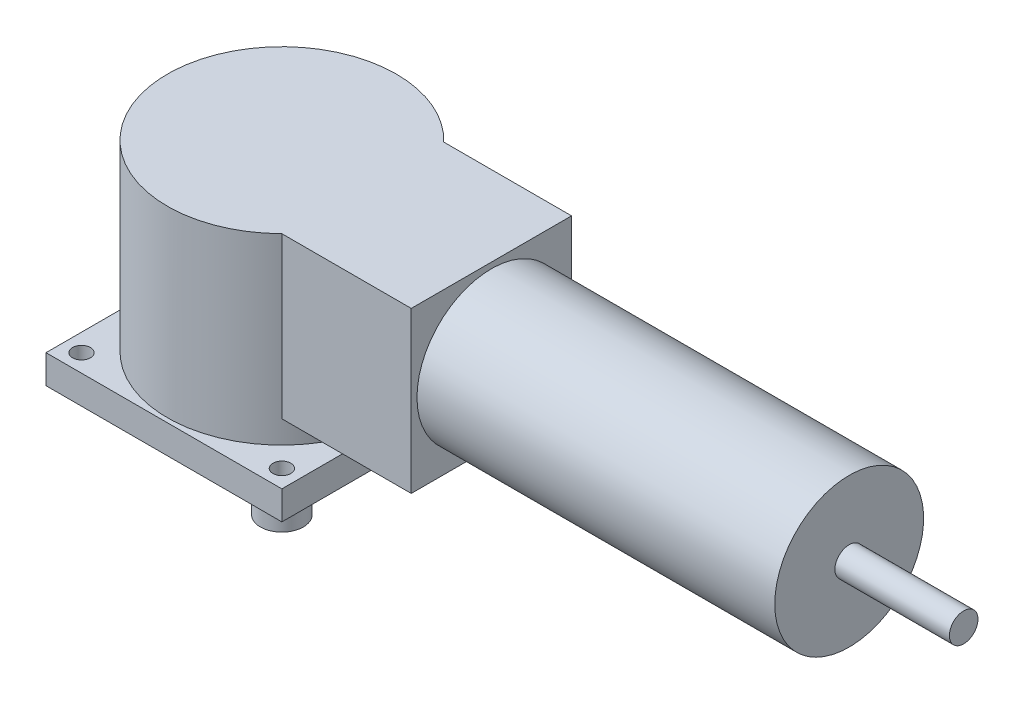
ISO-10303-21;
HEADER;
FILE_DESCRIPTION(('STEP AP214'),'2;1');
FILE_NAME('part.step','',(''),(''),'','','');
FILE_SCHEMA(('AUTOMOTIVE_DESIGN { 1 0 10303 214 1 1 1 1 }'));
ENDSEC;
DATA;
#1=APPLICATION_CONTEXT('core data for automotive mechanical design processes');
#2=APPLICATION_PROTOCOL_DEFINITION('international standard','automotive_design',2000,#1);
#3=PRODUCT_CONTEXT('',#1,'mechanical');
#4=PRODUCT('Part','Part','',(#3));
#5=PRODUCT_RELATED_PRODUCT_CATEGORY('part','',(#4));
#6=PRODUCT_DEFINITION_FORMATION('','',#4);
#7=PRODUCT_DEFINITION_CONTEXT('part definition',#1,'design');
#8=PRODUCT_DEFINITION('design','',#6,#7);
#9=PRODUCT_DEFINITION_SHAPE('','',#8);
#10=(LENGTH_UNIT() NAMED_UNIT(*) SI_UNIT(.MILLI.,.METRE.));
#11=(NAMED_UNIT(*) PLANE_ANGLE_UNIT() SI_UNIT($,.RADIAN.));
#12=(NAMED_UNIT(*) SI_UNIT($,.STERADIAN.) SOLID_ANGLE_UNIT());
#13=UNCERTAINTY_MEASURE_WITH_UNIT(LENGTH_MEASURE(1.E-05),#10,'distance_accuracy_value','');
#14=(GEOMETRIC_REPRESENTATION_CONTEXT(3) GLOBAL_UNCERTAINTY_ASSIGNED_CONTEXT((#13)) GLOBAL_UNIT_ASSIGNED_CONTEXT((#10,
#11,#12)) REPRESENTATION_CONTEXT('',''));
#15=CARTESIAN_POINT('',(0.,0.,0.));
#16=DIRECTION('',(0.,0.,1.));
#17=DIRECTION('',(1.,0.,0.));
#18=AXIS2_PLACEMENT_3D('',#15,#16,#17);
#19=CARTESIAN_POINT('',(-26.162,-2.794,26.162));
#20=DIRECTION('',(0.,-1.,0.));
#21=DIRECTION('',(0.,0.,-1.));
#22=AXIS2_PLACEMENT_3D('',#19,#20,#21);
#23=PLANE('',#22);
#24=CARTESIAN_POINT('',(-26.162,-2.794,26.162));
#25=DIRECTION('',(0.,-1.,0.));
#26=DIRECTION('',(0.,0.,-1.));
#27=AXIS2_PLACEMENT_3D('',#24,#25,#26);
#28=CIRCLE('',#27,15.875);
#29=CARTESIAN_POINT('',(-26.162,-2.794,10.287));
#30=VERTEX_POINT('',#29);
#31=EDGE_CURVE('E216',#30,#30,#28,.T.);
#32=ORIENTED_EDGE('',*,*,#31,.T.);
#33=EDGE_LOOP('',(#32));
#34=FACE_BOUND('',#33,.T.);
#35=CARTESIAN_POINT('',(-26.162,-2.794,26.162));
#36=DIRECTION('',(0.,-1.,0.));
#37=DIRECTION('',(0.,0.,-1.));
#38=AXIS2_PLACEMENT_3D('',#35,#36,#37);
#39=CIRCLE('',#38,4.7625);
#40=CARTESIAN_POINT('',(-26.162,-2.794,30.9245));
#41=VERTEX_POINT('',#40);
#42=EDGE_CURVE('E223',#41,#41,#39,.T.);
#43=ORIENTED_EDGE('',*,*,#42,.F.);
#44=EDGE_LOOP('',(#43));
#45=FACE_BOUND('',#44,.T.);
#46=ADVANCED_FACE('F38',(#34,#45),#23,.T.);
#47=CARTESIAN_POINT('',(0.,0.,52.324));
#48=DIRECTION('',(0.,-1.,0.));
#49=DIRECTION('',(0.,0.,-1.));
#50=AXIS2_PLACEMENT_3D('',#47,#48,#49);
#51=PLANE('',#50);
#52=DIRECTION('',(0.,0.,-1.));
#53=VECTOR('',#52,1.);
#54=CARTESIAN_POINT('',(0.,0.,0.));
#55=LINE('',#54,#53);
#56=CARTESIAN_POINT('',(0.,0.,52.324));
#57=VERTEX_POINT('',#56);
#58=CARTESIAN_POINT('',(0.,0.,0.));
#59=VERTEX_POINT('',#58);
#60=EDGE_CURVE('E175',#57,#59,#55,.T.);
#61=ORIENTED_EDGE('',*,*,#60,.F.);
#62=DIRECTION('',(1.,0.,0.));
#63=VECTOR('',#62,1.);
#64=CARTESIAN_POINT('',(0.,0.,52.324));
#65=LINE('',#64,#63);
#66=CARTESIAN_POINT('',(-52.324,0.,52.324));
#67=VERTEX_POINT('',#66);
#68=EDGE_CURVE('E83',#67,#57,#65,.T.);
#69=ORIENTED_EDGE('',*,*,#68,.F.);
#70=DIRECTION('',(0.,0.,1.));
#71=VECTOR('',#70,1.);
#72=CARTESIAN_POINT('',(-52.324,0.,0.));
#73=LINE('',#72,#71);
#74=CARTESIAN_POINT('',(-52.324,0.,0.));
#75=VERTEX_POINT('',#74);
#76=EDGE_CURVE('E187',#75,#67,#73,.T.);
#77=ORIENTED_EDGE('',*,*,#76,.F.);
#78=DIRECTION('',(-1.,0.,0.));
#79=VECTOR('',#78,1.);
#80=CARTESIAN_POINT('',(0.,0.,0.));
#81=LINE('',#80,#79);
#82=EDGE_CURVE('E185',#59,#75,#81,.T.);
#83=ORIENTED_EDGE('',*,*,#82,.F.);
#84=EDGE_LOOP('',(#61,#69,#77,#83));
#85=FACE_BOUND('',#84,.T.);
#86=CARTESIAN_POINT('',(-48.387,0.,3.937));
#87=DIRECTION('',(0.,-1.,0.));
#88=DIRECTION('',(0.,0.,-1.));
#89=AXIS2_PLACEMENT_3D('',#86,#87,#88);
#90=CIRCLE('',#89,1.984375);
#91=CARTESIAN_POINT('',(-48.387,0.,1.95262500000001));
#92=VERTEX_POINT('',#91);
#93=EDGE_CURVE('E172',#92,#92,#90,.T.);
#94=ORIENTED_EDGE('',*,*,#93,.F.);
#95=EDGE_LOOP('',(#94));
#96=FACE_BOUND('',#95,.T.);
#97=CARTESIAN_POINT('',(-48.387,0.,48.387));
#98=DIRECTION('',(0.,-1.,0.));
#99=DIRECTION('',(0.,0.,-1.));
#100=AXIS2_PLACEMENT_3D('',#97,#98,#99);
#101=CIRCLE('',#100,1.984375);
#102=CARTESIAN_POINT('',(-48.387,0.,46.402625));
#103=VERTEX_POINT('',#102);
#104=EDGE_CURVE('E168',#103,#103,#101,.T.);
#105=ORIENTED_EDGE('',*,*,#104,.F.);
#106=EDGE_LOOP('',(#105));
#107=FACE_BOUND('',#106,.T.);
#108=CARTESIAN_POINT('',(-3.937,0.,3.937));
#109=DIRECTION('',(0.,-1.,0.));
#110=DIRECTION('',(0.,0.,-1.));
#111=AXIS2_PLACEMENT_3D('',#108,#109,#110);
#112=CIRCLE('',#111,1.984375);
#113=CARTESIAN_POINT('',(-3.937,0.,1.952625));
#114=VERTEX_POINT('',#113);
#115=EDGE_CURVE('E164',#114,#114,#112,.T.);
#116=ORIENTED_EDGE('',*,*,#115,.F.);
#117=EDGE_LOOP('',(#116));
#118=FACE_BOUND('',#117,.T.);
#119=CARTESIAN_POINT('',(-3.937,0.,48.387));
#120=DIRECTION('',(0.,-1.,0.));
#121=DIRECTION('',(0.,0.,-1.));
#122=AXIS2_PLACEMENT_3D('',#119,#120,#121);
#123=CIRCLE('',#122,1.984375);
#124=CARTESIAN_POINT('',(-3.937,0.,46.402625));
#125=VERTEX_POINT('',#124);
#126=EDGE_CURVE('E160',#125,#125,#123,.T.);
#127=ORIENTED_EDGE('',*,*,#126,.F.);
#128=EDGE_LOOP('',(#127));
#129=FACE_BOUND('',#128,.T.);
#130=CARTESIAN_POINT('',(-26.162,0.,26.162));
#131=DIRECTION('',(0.,-1.,0.));
#132=DIRECTION('',(0.,0.,-1.));
#133=AXIS2_PLACEMENT_3D('',#130,#131,#132);
#134=CIRCLE('',#133,15.875);
#135=CARTESIAN_POINT('',(-26.162,0.,10.287));
#136=VERTEX_POINT('',#135);
#137=EDGE_CURVE('E214',#136,#136,#134,.T.);
#138=ORIENTED_EDGE('',*,*,#137,.F.);
#139=EDGE_LOOP('',(#138));
#140=FACE_BOUND('',#139,.T.);
#141=ADVANCED_FACE('F206',(#85,#96,#107,#118,#129,#140),#51,.T.);
#142=CARTESIAN_POINT('',(99.695,29.21,26.162));
#143=DIRECTION('',(1.,0.,0.));
#144=DIRECTION('',(0.,0.,-1.));
#145=AXIS2_PLACEMENT_3D('',#142,#143,#144);
#146=PLANE('',#145);
#147=CARTESIAN_POINT('',(99.695,29.21,26.162));
#148=DIRECTION('',(1.,0.,0.));
#149=DIRECTION('',(0.,0.,-1.));
#150=AXIS2_PLACEMENT_3D('',#147,#148,#149);
#151=CIRCLE('',#150,16.51);
#152=CARTESIAN_POINT('',(99.695,29.21,42.672));
#153=VERTEX_POINT('',#152);
#154=EDGE_CURVE('E135',#153,#153,#151,.T.);
#155=ORIENTED_EDGE('',*,*,#154,.T.);
#156=EDGE_LOOP('',(#155));
#157=FACE_BOUND('',#156,.T.);
#158=CARTESIAN_POINT('',(99.695,29.21,26.162));
#159=DIRECTION('',(1.,0.,0.));
#160=DIRECTION('',(0.,0.,-1.));
#161=AXIS2_PLACEMENT_3D('',#158,#159,#160);
#162=CIRCLE('',#161,3.175);
#163=CARTESIAN_POINT('',(99.695,29.21,22.987));
#164=VERTEX_POINT('',#163);
#165=EDGE_CURVE('E220',#164,#164,#162,.T.);
#166=ORIENTED_EDGE('',*,*,#165,.F.);
#167=EDGE_LOOP('',(#166));
#168=FACE_BOUND('',#167,.T.);
#169=ADVANCED_FACE('F209',(#157,#168),#146,.T.);
#170=CARTESIAN_POINT('',(20.32,6.35,0.));
#171=DIRECTION('',(1.,0.,0.));
#172=DIRECTION('',(0.,0.,-1.));
#173=AXIS2_PLACEMENT_3D('',#170,#171,#172);
#174=PLANE('',#173);
#175=DIRECTION('',(0.,0.,-1.));
#176=VECTOR('',#175,1.);
#177=CARTESIAN_POINT('',(20.32,11.43,8.38200000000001));
#178=LINE('',#177,#176);
#179=CARTESIAN_POINT('',(20.32,11.43,43.942));
#180=VERTEX_POINT('',#179);
#181=CARTESIAN_POINT('',(20.32,11.43,8.382));
#182=VERTEX_POINT('',#181);
#183=EDGE_CURVE('E128',#180,#182,#178,.T.);
#184=ORIENTED_EDGE('',*,*,#183,.T.);
#185=DIRECTION('',(0.,1.,0.));
#186=VECTOR('',#185,1.);
#187=CARTESIAN_POINT('',(20.32,46.99,8.38200000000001));
#188=LINE('',#187,#186);
#189=CARTESIAN_POINT('',(20.32,46.99,8.38200000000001));
#190=VERTEX_POINT('',#189);
#191=EDGE_CURVE('E134',#182,#190,#188,.T.);
#192=ORIENTED_EDGE('',*,*,#191,.T.);
#193=DIRECTION('',(0.,0.,1.));
#194=VECTOR('',#193,1.);
#195=CARTESIAN_POINT('',(20.32,46.99,8.38200000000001));
#196=LINE('',#195,#194);
#197=CARTESIAN_POINT('',(20.32,46.99,43.942));
#198=VERTEX_POINT('',#197);
#199=EDGE_CURVE('E139',#190,#198,#196,.T.);
#200=ORIENTED_EDGE('',*,*,#199,.T.);
#201=DIRECTION('',(0.,-1.,0.));
#202=VECTOR('',#201,1.);
#203=CARTESIAN_POINT('',(20.32,46.99,43.942));
#204=LINE('',#203,#202);
#205=EDGE_CURVE('E118',#198,#180,#204,.T.);
#206=ORIENTED_EDGE('',*,*,#205,.T.);
#207=EDGE_LOOP('',(#184,#192,#200,#206));
#208=FACE_BOUND('',#207,.T.);
#209=CARTESIAN_POINT('',(20.32,29.21,26.162));
#210=DIRECTION('',(1.,0.,0.));
#211=DIRECTION('',(0.,0.,-1.));
#212=AXIS2_PLACEMENT_3D('',#209,#210,#211);
#213=CIRCLE('',#212,16.51);
#214=CARTESIAN_POINT('',(20.32,29.21,42.672));
#215=VERTEX_POINT('',#214);
#216=EDGE_CURVE('E145',#215,#215,#213,.T.);
#217=ORIENTED_EDGE('',*,*,#216,.F.);
#218=EDGE_LOOP('',(#217));
#219=FACE_BOUND('',#218,.T.);
#220=ADVANCED_FACE('F137',(#208,#219),#174,.T.);
#221=CARTESIAN_POINT('',(0.,6.35,52.324));
#222=DIRECTION('',(0.,-1.,0.));
#223=DIRECTION('',(0.,0.,-1.));
#224=AXIS2_PLACEMENT_3D('',#221,#222,#223);
#225=PLANE('',#224);
#226=DIRECTION('',(0.,0.,-1.));
#227=VECTOR('',#226,1.);
#228=CARTESIAN_POINT('',(0.,6.35,0.));
#229=LINE('',#228,#227);
#230=CARTESIAN_POINT('',(0.,6.35,52.324));
#231=VERTEX_POINT('',#230);
#232=CARTESIAN_POINT('',(0.,6.35,0.));
#233=VERTEX_POINT('',#232);
#234=EDGE_CURVE('E176',#231,#233,#229,.T.);
#235=ORIENTED_EDGE('',*,*,#234,.T.);
#236=DIRECTION('',(-1.,0.,0.));
#237=VECTOR('',#236,1.);
#238=CARTESIAN_POINT('',(0.,6.35,0.));
#239=LINE('',#238,#237);
#240=CARTESIAN_POINT('',(-52.324,6.35,0.));
#241=VERTEX_POINT('',#240);
#242=EDGE_CURVE('E91',#233,#241,#239,.T.);
#243=ORIENTED_EDGE('',*,*,#242,.T.);
#244=DIRECTION('',(0.,0.,1.));
#245=VECTOR('',#244,1.);
#246=CARTESIAN_POINT('',(-52.324,6.35,0.));
#247=LINE('',#246,#245);
#248=CARTESIAN_POINT('',(-52.324,6.35,52.324));
#249=VERTEX_POINT('',#248);
#250=EDGE_CURVE('E179',#241,#249,#247,.T.);
#251=ORIENTED_EDGE('',*,*,#250,.T.);
#252=DIRECTION('',(1.,0.,0.));
#253=VECTOR('',#252,1.);
#254=CARTESIAN_POINT('',(0.,6.35,52.324));
#255=LINE('',#254,#253);
#256=EDGE_CURVE('E62',#249,#231,#255,.T.);
#257=ORIENTED_EDGE('',*,*,#256,.T.);
#258=EDGE_LOOP('',(#235,#243,#251,#257));
#259=FACE_BOUND('',#258,.T.);
#260=CARTESIAN_POINT('',(-48.387,6.35,3.937));
#261=DIRECTION('',(0.,1.,0.));
#262=DIRECTION('',(0.,0.,1.));
#263=AXIS2_PLACEMENT_3D('',#260,#261,#262);
#264=CIRCLE('',#263,1.984375);
#265=CARTESIAN_POINT('',(-48.387,6.35,5.921375));
#266=VERTEX_POINT('',#265);
#267=EDGE_CURVE('E169',#266,#266,#264,.T.);
#268=ORIENTED_EDGE('',*,*,#267,.F.);
#269=EDGE_LOOP('',(#268));
#270=FACE_BOUND('',#269,.T.);
#271=CARTESIAN_POINT('',(-48.387,6.35,48.387));
#272=DIRECTION('',(0.,1.,0.));
#273=DIRECTION('',(0.,0.,1.));
#274=AXIS2_PLACEMENT_3D('',#271,#272,#273);
#275=CIRCLE('',#274,1.984375);
#276=CARTESIAN_POINT('',(-48.387,6.35,50.371375));
#277=VERTEX_POINT('',#276);
#278=EDGE_CURVE('E165',#277,#277,#275,.T.);
#279=ORIENTED_EDGE('',*,*,#278,.F.);
#280=EDGE_LOOP('',(#279));
#281=FACE_BOUND('',#280,.T.);
#282=CARTESIAN_POINT('',(-3.937,6.35,3.937));
#283=DIRECTION('',(0.,1.,0.));
#284=DIRECTION('',(0.,0.,1.));
#285=AXIS2_PLACEMENT_3D('',#282,#283,#284);
#286=CIRCLE('',#285,1.984375);
#287=CARTESIAN_POINT('',(-3.937,6.35,5.921375));
#288=VERTEX_POINT('',#287);
#289=EDGE_CURVE('E161',#288,#288,#286,.T.);
#290=ORIENTED_EDGE('',*,*,#289,.F.);
#291=EDGE_LOOP('',(#290));
#292=FACE_BOUND('',#291,.T.);
#293=CARTESIAN_POINT('',(-3.937,6.35,48.387));
#294=DIRECTION('',(0.,1.,0.));
#295=DIRECTION('',(0.,0.,1.));
#296=AXIS2_PLACEMENT_3D('',#293,#294,#295);
#297=CIRCLE('',#296,1.984375);
#298=CARTESIAN_POINT('',(-3.937,6.35,50.371375));
#299=VERTEX_POINT('',#298);
#300=EDGE_CURVE('E157',#299,#299,#297,.T.);
#301=ORIENTED_EDGE('',*,*,#300,.F.);
#302=EDGE_LOOP('',(#301));
#303=FACE_BOUND('',#302,.T.);
#304=CARTESIAN_POINT('',(-26.3525,6.35,25.9715));
#305=DIRECTION('',(0.,-1.,0.));
#306=DIRECTION('',(0.,0.,-1.));
#307=AXIS2_PLACEMENT_3D('',#304,#305,#306);
#308=CIRCLE('',#307,25.4);
#309=CARTESIAN_POINT('',(-26.3525,6.35,0.571500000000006));
#310=VERTEX_POINT('',#309);
#311=EDGE_CURVE('E12',#310,#310,#308,.F.);
#312=ORIENTED_EDGE('',*,*,#311,.F.);
#313=EDGE_LOOP('',(#312));
#314=FACE_BOUND('',#313,.T.);
#315=ADVANCED_FACE('F239',(#259,#270,#281,#292,#303,#314),#225,.F.);
#316=CARTESIAN_POINT('',(0.,6.35,0.));
#317=DIRECTION('',(-1.,0.,0.));
#318=DIRECTION('',(0.,0.,1.));
#319=AXIS2_PLACEMENT_3D('',#316,#317,#318);
#320=PLANE('',#319);
#321=ORIENTED_EDGE('',*,*,#60,.T.);
#322=DIRECTION('',(0.,-1.,0.));
#323=VECTOR('',#322,1.);
#324=CARTESIAN_POINT('',(0.,6.35,0.));
#325=LINE('',#324,#323);
#326=EDGE_CURVE('E46',#233,#59,#325,.T.);
#327=ORIENTED_EDGE('',*,*,#326,.F.);
#328=ORIENTED_EDGE('',*,*,#234,.F.);
#329=DIRECTION('',(0.,-1.,0.));
#330=VECTOR('',#329,1.);
#331=CARTESIAN_POINT('',(0.,6.35,52.324));
#332=LINE('',#331,#330);
#333=EDGE_CURVE('E182',#231,#57,#332,.T.);
#334=ORIENTED_EDGE('',*,*,#333,.T.);
#335=EDGE_LOOP('',(#321,#327,#328,#334));
#336=FACE_BOUND('',#335,.T.);
#337=ADVANCED_FACE('F40',(#336),#320,.F.);
#338=CARTESIAN_POINT('',(0.,6.35,0.));
#339=DIRECTION('',(0.,0.,1.));
#340=DIRECTION('',(1.,0.,0.));
#341=AXIS2_PLACEMENT_3D('',#338,#339,#340);
#342=PLANE('',#341);
#343=ORIENTED_EDGE('',*,*,#82,.T.);
#344=DIRECTION('',(0.,-1.,0.));
#345=VECTOR('',#344,1.);
#346=CARTESIAN_POINT('',(-52.324,6.35,0.));
#347=LINE('',#346,#345);
#348=EDGE_CURVE('E193',#241,#75,#347,.T.);
#349=ORIENTED_EDGE('',*,*,#348,.F.);
#350=ORIENTED_EDGE('',*,*,#242,.F.);
#351=ORIENTED_EDGE('',*,*,#326,.T.);
#352=EDGE_LOOP('',(#343,#349,#350,#351));
#353=FACE_BOUND('',#352,.T.);
#354=ADVANCED_FACE('F310',(#353),#342,.F.);
#355=CARTESIAN_POINT('',(-52.324,6.35,0.));
#356=DIRECTION('',(1.,0.,0.));
#357=DIRECTION('',(0.,0.,-1.));
#358=AXIS2_PLACEMENT_3D('',#355,#356,#357);
#359=PLANE('',#358);
#360=ORIENTED_EDGE('',*,*,#76,.T.);
#361=DIRECTION('',(0.,-1.,0.));
#362=VECTOR('',#361,1.);
#363=CARTESIAN_POINT('',(-52.324,6.35,52.324));
#364=LINE('',#363,#362);
#365=EDGE_CURVE('E191',#249,#67,#364,.T.);
#366=ORIENTED_EDGE('',*,*,#365,.F.);
#367=ORIENTED_EDGE('',*,*,#250,.F.);
#368=ORIENTED_EDGE('',*,*,#348,.T.);
#369=EDGE_LOOP('',(#360,#366,#367,#368));
#370=FACE_BOUND('',#369,.T.);
#371=ADVANCED_FACE('F308',(#370),#359,.F.);
#372=CARTESIAN_POINT('',(0.,6.35,52.324));
#373=DIRECTION('',(0.,0.,-1.));
#374=DIRECTION('',(-1.,0.,0.));
#375=AXIS2_PLACEMENT_3D('',#372,#373,#374);
#376=PLANE('',#375);
#377=ORIENTED_EDGE('',*,*,#68,.T.);
#378=ORIENTED_EDGE('',*,*,#333,.F.);
#379=ORIENTED_EDGE('',*,*,#256,.F.);
#380=ORIENTED_EDGE('',*,*,#365,.T.);
#381=EDGE_LOOP('',(#377,#378,#379,#380));
#382=FACE_BOUND('',#381,.T.);
#383=ADVANCED_FACE('F303',(#382),#376,.F.);
#384=CARTESIAN_POINT('',(-48.387,6.35,3.937));
#385=DIRECTION('',(0.,1.,0.));
#386=DIRECTION('',(0.,0.,1.));
#387=AXIS2_PLACEMENT_3D('',#384,#385,#386);
#388=CYLINDRICAL_SURFACE('',#387,1.984375);
#389=ORIENTED_EDGE('',*,*,#93,.T.);
#390=EDGE_LOOP('',(#389));
#391=FACE_BOUND('',#390,.T.);
#392=ORIENTED_EDGE('',*,*,#267,.T.);
#393=EDGE_LOOP('',(#392));
#394=FACE_BOUND('',#393,.T.);
#395=ADVANCED_FACE('F300',(#391,#394),#388,.F.);
#396=CARTESIAN_POINT('',(-48.387,6.35,48.387));
#397=DIRECTION('',(0.,1.,0.));
#398=DIRECTION('',(0.,0.,1.));
#399=AXIS2_PLACEMENT_3D('',#396,#397,#398);
#400=CYLINDRICAL_SURFACE('',#399,1.984375);
#401=ORIENTED_EDGE('',*,*,#104,.T.);
#402=EDGE_LOOP('',(#401));
#403=FACE_BOUND('',#402,.T.);
#404=ORIENTED_EDGE('',*,*,#278,.T.);
#405=EDGE_LOOP('',(#404));
#406=FACE_BOUND('',#405,.T.);
#407=ADVANCED_FACE('F296',(#403,#406),#400,.F.);
#408=CARTESIAN_POINT('',(-3.937,6.35,3.937));
#409=DIRECTION('',(0.,1.,0.));
#410=DIRECTION('',(0.,0.,1.));
#411=AXIS2_PLACEMENT_3D('',#408,#409,#410);
#412=CYLINDRICAL_SURFACE('',#411,1.984375);
#413=ORIENTED_EDGE('',*,*,#115,.T.);
#414=EDGE_LOOP('',(#413));
#415=FACE_BOUND('',#414,.T.);
#416=ORIENTED_EDGE('',*,*,#289,.T.);
#417=EDGE_LOOP('',(#416));
#418=FACE_BOUND('',#417,.T.);
#419=ADVANCED_FACE('F293',(#415,#418),#412,.F.);
#420=CARTESIAN_POINT('',(-3.937,6.35,48.387));
#421=DIRECTION('',(0.,1.,0.));
#422=DIRECTION('',(0.,0.,1.));
#423=AXIS2_PLACEMENT_3D('',#420,#421,#422);
#424=CYLINDRICAL_SURFACE('',#423,1.984375);
#425=ORIENTED_EDGE('',*,*,#126,.T.);
#426=EDGE_LOOP('',(#425));
#427=FACE_BOUND('',#426,.T.);
#428=ORIENTED_EDGE('',*,*,#300,.T.);
#429=EDGE_LOOP('',(#428));
#430=FACE_BOUND('',#429,.T.);
#431=ADVANCED_FACE('F203',(#427,#430),#424,.F.);
#432=CARTESIAN_POINT('',(-26.3525,46.99,25.9715));
#433=DIRECTION('',(0.,-1.,0.));
#434=DIRECTION('',(0.,0.,-1.));
#435=AXIS2_PLACEMENT_3D('',#432,#433,#434);
#436=CYLINDRICAL_SURFACE('',#435,25.4);
#437=CARTESIAN_POINT('',(-26.3525,46.99,25.9715));
#438=DIRECTION('',(0.,1.,0.));
#439=DIRECTION('',(0.,0.,1.));
#440=AXIS2_PLACEMENT_3D('',#437,#438,#439);
#441=CIRCLE('',#440,25.4);
#442=CARTESIAN_POINT('',(-8.02848598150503,46.99,8.38200000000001));
#443=VERTEX_POINT('',#442);
#444=CARTESIAN_POINT('',(-8.40198107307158,46.99,43.942));
#445=VERTEX_POINT('',#444);
#446=EDGE_CURVE('E155',#443,#445,#441,.T.);
#447=ORIENTED_EDGE('',*,*,#446,.F.);
#448=DIRECTION('',(0.,-1.,0.));
#449=VECTOR('',#448,1.);
#450=CARTESIAN_POINT('',(-8.02848598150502,46.99,8.38200000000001));
#451=LINE('',#450,#449);
#452=CARTESIAN_POINT('',(-8.02848598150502,11.43,8.38200000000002));
#453=VERTEX_POINT('',#452);
#454=EDGE_CURVE('E140',#453,#443,#451,.F.);
#455=ORIENTED_EDGE('',*,*,#454,.F.);
#456=CARTESIAN_POINT('',(-26.3525,11.43,25.9715));
#457=DIRECTION('',(0.,-1.,0.));
#458=DIRECTION('',(0.,0.,-1.));
#459=AXIS2_PLACEMENT_3D('',#456,#457,#458);
#460=CIRCLE('',#459,25.4);
#461=CARTESIAN_POINT('',(-8.40198107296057,11.43,43.942));
#462=VERTEX_POINT('',#461);
#463=EDGE_CURVE('E150',#462,#453,#460,.F.);
#464=ORIENTED_EDGE('',*,*,#463,.F.);
#465=DIRECTION('',(0.,-1.,0.));
#466=VECTOR('',#465,1.);
#467=CARTESIAN_POINT('',(-8.40198107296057,46.99,43.942));
#468=LINE('',#467,#466);
#469=EDGE_CURVE('E121',#445,#462,#468,.T.);
#470=ORIENTED_EDGE('',*,*,#469,.F.);
#471=EDGE_LOOP('',(#447,#455,#464,#470));
#472=FACE_BOUND('',#471,.T.);
#473=ORIENTED_EDGE('',*,*,#311,.T.);
#474=EDGE_LOOP('',(#473));
#475=FACE_BOUND('',#474,.T.);
#476=ADVANCED_FACE('F285',(#472,#475),#436,.T.);
#477=CARTESIAN_POINT('',(-26.3525,46.99,25.9715));
#478=DIRECTION('',(0.,1.,0.));
#479=DIRECTION('',(0.,0.,1.));
#480=AXIS2_PLACEMENT_3D('',#477,#478,#479);
#481=PLANE('',#480);
#482=ORIENTED_EDGE('',*,*,#446,.T.);
#483=DIRECTION('',(1.,0.,0.));
#484=VECTOR('',#483,1.);
#485=CARTESIAN_POINT('',(-500000.,46.99,43.9420000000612));
#486=LINE('',#485,#484);
#487=EDGE_CURVE('E125',#445,#198,#486,.T.);
#488=ORIENTED_EDGE('',*,*,#487,.T.);
#489=ORIENTED_EDGE('',*,*,#199,.F.);
#490=DIRECTION('',(1.,0.,0.));
#491=VECTOR('',#490,1.);
#492=CARTESIAN_POINT('',(-500000.,46.99,8.38200000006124));
#493=LINE('',#492,#491);
#494=EDGE_CURVE('E53',#443,#190,#493,.T.);
#495=ORIENTED_EDGE('',*,*,#494,.F.);
#496=EDGE_LOOP('',(#482,#488,#489,#495));
#497=FACE_BOUND('',#496,.T.);
#498=ADVANCED_FACE('F277',(#497),#481,.T.);
#499=CARTESIAN_POINT('',(-500000.,46.99,8.38200000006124));
#500=DIRECTION('',(0.,0.,-1.));
#501=DIRECTION('',(0.,1.,0.));
#502=AXIS2_PLACEMENT_3D('',#499,#500,#501);
#503=PLANE('',#502);
#504=DIRECTION('',(1.,0.,0.));
#505=VECTOR('',#504,1.);
#506=CARTESIAN_POINT('',(-500000.,11.43,8.38200000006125));
#507=LINE('',#506,#505);
#508=EDGE_CURVE('E124',#453,#182,#507,.T.);
#509=ORIENTED_EDGE('',*,*,#508,.F.);
#510=ORIENTED_EDGE('',*,*,#454,.T.);
#511=ORIENTED_EDGE('',*,*,#494,.T.);
#512=ORIENTED_EDGE('',*,*,#191,.F.);
#513=EDGE_LOOP('',(#509,#510,#511,#512));
#514=FACE_BOUND('',#513,.T.);
#515=ADVANCED_FACE('F272',(#514),#503,.T.);
#516=CARTESIAN_POINT('',(-500000.,46.99,43.9420000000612));
#517=DIRECTION('',(0.,0.,1.));
#518=DIRECTION('',(0.,-1.,0.));
#519=AXIS2_PLACEMENT_3D('',#516,#517,#518);
#520=PLANE('',#519);
#521=ORIENTED_EDGE('',*,*,#487,.F.);
#522=ORIENTED_EDGE('',*,*,#469,.T.);
#523=DIRECTION('',(1.,0.,0.));
#524=VECTOR('',#523,1.);
#525=CARTESIAN_POINT('',(-500000.,11.43,43.9420000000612));
#526=LINE('',#525,#524);
#527=EDGE_CURVE('E114',#462,#180,#526,.T.);
#528=ORIENTED_EDGE('',*,*,#527,.T.);
#529=ORIENTED_EDGE('',*,*,#205,.F.);
#530=EDGE_LOOP('',(#521,#522,#528,#529));
#531=FACE_BOUND('',#530,.T.);
#532=ADVANCED_FACE('F116',(#531),#520,.T.);
#533=CARTESIAN_POINT('',(-500000.,11.43,8.38200000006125));
#534=DIRECTION('',(0.,-1.,0.));
#535=DIRECTION('',(0.,0.,-1.));
#536=AXIS2_PLACEMENT_3D('',#533,#534,#535);
#537=PLANE('',#536);
#538=ORIENTED_EDGE('',*,*,#527,.F.);
#539=ORIENTED_EDGE('',*,*,#463,.T.);
#540=ORIENTED_EDGE('',*,*,#508,.T.);
#541=ORIENTED_EDGE('',*,*,#183,.F.);
#542=EDGE_LOOP('',(#538,#539,#540,#541));
#543=FACE_BOUND('',#542,.T.);
#544=ADVANCED_FACE('F129',(#543),#537,.T.);
#545=CARTESIAN_POINT('',(99.695,29.21,26.162));
#546=DIRECTION('',(-1.,0.,0.));
#547=DIRECTION('',(0.,0.,1.));
#548=AXIS2_PLACEMENT_3D('',#545,#546,#547);
#549=CYLINDRICAL_SURFACE('',#548,16.51);
#550=CARTESIAN_POINT('',(99.695,29.21,42.672));
#551=CARTESIAN_POINT('',(98.8681770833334,29.21,42.672));
#552=CARTESIAN_POINT('',(98.0413541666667,29.21,42.672));
#553=CARTESIAN_POINT('',(96.3877083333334,29.21,42.672));
#554=CARTESIAN_POINT('',(95.5608854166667,29.21,42.672));
#555=CARTESIAN_POINT('',(93.9072395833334,29.21,42.672));
#556=CARTESIAN_POINT('',(93.0804166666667,29.21,42.672));
#557=CARTESIAN_POINT('',(91.4267708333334,29.21,42.672));
#558=CARTESIAN_POINT('',(90.5999479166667,29.21,42.672));
#559=CARTESIAN_POINT('',(88.9463020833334,29.21,42.672));
#560=CARTESIAN_POINT('',(88.1194791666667,29.21,42.672));
#561=CARTESIAN_POINT('',(86.4658333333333,29.21,42.672));
#562=CARTESIAN_POINT('',(85.6390104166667,29.21,42.672));
#563=CARTESIAN_POINT('',(83.9853645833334,29.21,42.672));
#564=CARTESIAN_POINT('',(83.1585416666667,29.21,42.672));
#565=CARTESIAN_POINT('',(81.5048958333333,29.21,42.672));
#566=CARTESIAN_POINT('',(80.6780729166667,29.21,42.672));
#567=CARTESIAN_POINT('',(79.0244270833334,29.21,42.672));
#568=CARTESIAN_POINT('',(78.1976041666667,29.21,42.672));
#569=CARTESIAN_POINT('',(76.5439583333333,29.21,42.672));
#570=CARTESIAN_POINT('',(75.7171354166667,29.21,42.672));
#571=CARTESIAN_POINT('',(74.0634895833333,29.21,42.672));
#572=CARTESIAN_POINT('',(73.2366666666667,29.21,42.672));
#573=CARTESIAN_POINT('',(71.5830208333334,29.21,42.672));
#574=CARTESIAN_POINT('',(70.7561979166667,29.21,42.672));
#575=CARTESIAN_POINT('',(69.1025520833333,29.21,42.672));
#576=CARTESIAN_POINT('',(68.2757291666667,29.21,42.672));
#577=CARTESIAN_POINT('',(66.6220833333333,29.21,42.672));
#578=CARTESIAN_POINT('',(65.7952604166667,29.21,42.672));
#579=CARTESIAN_POINT('',(64.1416145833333,29.21,42.672));
#580=CARTESIAN_POINT('',(63.3147916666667,29.21,42.672));
#581=CARTESIAN_POINT('',(61.6611458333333,29.21,42.672));
#582=CARTESIAN_POINT('',(60.8343229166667,29.21,42.672));
#583=CARTESIAN_POINT('',(59.1806770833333,29.21,42.672));
#584=CARTESIAN_POINT('',(58.3538541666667,29.21,42.672));
#585=CARTESIAN_POINT('',(56.7002083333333,29.21,42.672));
#586=CARTESIAN_POINT('',(55.8733854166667,29.21,42.672));
#587=CARTESIAN_POINT('',(54.2197395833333,29.21,42.672));
#588=CARTESIAN_POINT('',(53.3929166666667,29.21,42.672));
#589=CARTESIAN_POINT('',(51.7392708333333,29.21,42.672));
#590=CARTESIAN_POINT('',(50.9124479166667,29.21,42.672));
#591=CARTESIAN_POINT('',(49.2588020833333,29.21,42.672));
#592=CARTESIAN_POINT('',(48.4319791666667,29.21,42.672));
#593=CARTESIAN_POINT('',(46.7783333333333,29.21,42.672));
#594=CARTESIAN_POINT('',(45.9515104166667,29.21,42.672));
#595=CARTESIAN_POINT('',(44.2978645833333,29.21,42.672));
#596=CARTESIAN_POINT('',(43.4710416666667,29.21,42.672));
#597=CARTESIAN_POINT('',(41.8173958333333,29.21,42.672));
#598=CARTESIAN_POINT('',(40.9905729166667,29.21,42.672));
#599=CARTESIAN_POINT('',(39.3369270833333,29.21,42.672));
#600=CARTESIAN_POINT('',(38.5101041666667,29.21,42.672));
#601=CARTESIAN_POINT('',(36.8564583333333,29.21,42.672));
#602=CARTESIAN_POINT('',(36.0296354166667,29.21,42.672));
#603=CARTESIAN_POINT('',(34.3759895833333,29.21,42.672));
#604=CARTESIAN_POINT('',(33.5491666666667,29.21,42.672));
#605=CARTESIAN_POINT('',(31.8955208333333,29.21,42.672));
#606=CARTESIAN_POINT('',(31.0686979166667,29.21,42.672));
#607=CARTESIAN_POINT('',(29.4150520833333,29.21,42.672));
#608=CARTESIAN_POINT('',(28.5882291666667,29.21,42.672));
#609=CARTESIAN_POINT('',(26.9345833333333,29.21,42.672));
#610=CARTESIAN_POINT('',(26.1077604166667,29.21,42.672));
#611=CARTESIAN_POINT('',(24.4541145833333,29.21,42.672));
#612=CARTESIAN_POINT('',(23.6272916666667,29.21,42.672));
#613=CARTESIAN_POINT('',(21.9736458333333,29.21,42.672));
#614=CARTESIAN_POINT('',(21.1468229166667,29.21,42.672));
#615=CARTESIAN_POINT('',(20.32,29.21,42.672));
#616=B_SPLINE_CURVE_WITH_KNOTS('',3,(#550,#551,#552,#553,#554,#555,#556,#557,#558,#559,#560,
#561,#562,#563,#564,#565,#566,#567,#568,#569,#570,#571,#572,#573,#574,#575,#576,#577,#578,#579,
#580,#581,#582,#583,#584,#585,#586,#587,#588,#589,#590,#591,#592,#593,#594,#595,#596,#597,#598,
#599,#600,#601,#602,#603,#604,#605,#606,#607,#608,#609,#610,#611,#612,#613,#614,#615),
.UNSPECIFIED.,.F.,.F.,(4,2,2,2,2,2,2,2,2,2,2,2,2,2,2,2,2,2,2,2,2,2,2,2,2,2,2,2,2,2,2,2,4),(0.,
2.48046875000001,4.96093750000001,7.44140625,9.92187500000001,12.40234375,14.8828125,
17.36328125,19.84375,22.32421875,24.8046875,27.28515625,29.765625,32.24609375,34.7265625,
37.20703125,39.6875,42.16796875,44.6484375,47.12890625,49.609375,52.08984375,54.5703125,
57.05078125,59.53125,62.01171875,64.4921875,66.97265625,69.453125,71.93359375,74.4140625,
76.89453125,79.375),.UNSPECIFIED.);
#617=EDGE_CURVE('BSEAM237',#153,#215,#616,.T.);
#618=ORIENTED_EDGE('',*,*,#154,.F.);
#619=ORIENTED_EDGE('',*,*,#216,.T.);
#620=ORIENTED_EDGE('',*,*,#617,.T.);
#621=ORIENTED_EDGE('',*,*,#617,.F.);
#622=EDGE_LOOP('',(#618,#620,#619,#621));
#623=FACE_BOUND('',#622,.T.);
#624=ADVANCED_FACE('F237',(#623),#549,.T.);
#625=CARTESIAN_POINT('',(125.095,29.21,26.162));
#626=DIRECTION('',(-1.,0.,0.));
#627=DIRECTION('',(0.,0.,1.));
#628=AXIS2_PLACEMENT_3D('',#625,#626,#627);
#629=CYLINDRICAL_SURFACE('',#628,3.175);
#630=CARTESIAN_POINT('',(125.095,29.21,26.162));
#631=DIRECTION('',(1.,0.,0.));
#632=DIRECTION('',(0.,0.,-1.));
#633=AXIS2_PLACEMENT_3D('',#630,#631,#632);
#634=CIRCLE('',#633,3.175);
#635=CARTESIAN_POINT('',(125.095,29.21,22.987));
#636=VERTEX_POINT('',#635);
#637=EDGE_CURVE('E227',#636,#636,#634,.T.);
#638=ORIENTED_EDGE('',*,*,#637,.F.);
#639=EDGE_LOOP('',(#638));
#640=FACE_BOUND('',#639,.T.);
#641=ORIENTED_EDGE('',*,*,#165,.T.);
#642=EDGE_LOOP('',(#641));
#643=FACE_BOUND('',#642,.T.);
#644=ADVANCED_FACE('F266',(#640,#643),#629,.T.);
#645=CARTESIAN_POINT('',(125.095,29.21,26.162));
#646=DIRECTION('',(1.,0.,0.));
#647=DIRECTION('',(0.,0.,-1.));
#648=AXIS2_PLACEMENT_3D('',#645,#646,#647);
#649=PLANE('',#648);
#650=ORIENTED_EDGE('',*,*,#637,.T.);
#651=EDGE_LOOP('',(#650));
#652=FACE_BOUND('',#651,.T.);
#653=ADVANCED_FACE('F262',(#652),#649,.T.);
#654=CARTESIAN_POINT('',(-26.162,-2.794,26.162));
#655=DIRECTION('',(0.,1.,0.));
#656=DIRECTION('',(0.,0.,1.));
#657=AXIS2_PLACEMENT_3D('',#654,#655,#656);
#658=CYLINDRICAL_SURFACE('',#657,15.875);
#659=ORIENTED_EDGE('',*,*,#31,.F.);
#660=EDGE_LOOP('',(#659));
#661=FACE_BOUND('',#660,.T.);
#662=ORIENTED_EDGE('',*,*,#137,.T.);
#663=EDGE_LOOP('',(#662));
#664=FACE_BOUND('',#663,.T.);
#665=ADVANCED_FACE('F259',(#661,#664),#658,.T.);
#666=CARTESIAN_POINT('',(-26.162,-24.765,26.162));
#667=DIRECTION('',(0.,1.,0.));
#668=DIRECTION('',(0.,0.,1.));
#669=AXIS2_PLACEMENT_3D('',#666,#667,#668);
#670=CYLINDRICAL_SURFACE('',#669,4.7625);
#671=CARTESIAN_POINT('',(-26.162,-24.765,26.162));
#672=DIRECTION('',(0.,-1.,0.));
#673=DIRECTION('',(0.,0.,-1.));
#674=AXIS2_PLACEMENT_3D('',#671,#672,#673);
#675=CIRCLE('',#674,4.7625);
#676=CARTESIAN_POINT('',(-26.162,-24.765,30.9245));
#677=VERTEX_POINT('',#676);
#678=EDGE_CURVE('E217',#677,#677,#675,.T.);
#679=CARTESIAN_POINT('',(-26.162,-24.765,30.9245));
#680=CARTESIAN_POINT('',(-26.162,-24.5361354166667,30.9245));
#681=CARTESIAN_POINT('',(-26.162,-24.3072708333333,30.9245));
#682=CARTESIAN_POINT('',(-26.162,-23.8495416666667,30.9245));
#683=CARTESIAN_POINT('',(-26.162,-23.6206770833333,30.9245));
#684=CARTESIAN_POINT('',(-26.162,-23.1629479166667,30.9245));
#685=CARTESIAN_POINT('',(-26.162,-22.9340833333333,30.9245));
#686=CARTESIAN_POINT('',(-26.162,-22.4763541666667,30.9245));
#687=CARTESIAN_POINT('',(-26.162,-22.2474895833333,30.9245));
#688=CARTESIAN_POINT('',(-26.162,-21.7897604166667,30.9245));
#689=CARTESIAN_POINT('',(-26.162,-21.5608958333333,30.9245));
#690=CARTESIAN_POINT('',(-26.162,-21.1031666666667,30.9245));
#691=CARTESIAN_POINT('',(-26.162,-20.8743020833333,30.9245));
#692=CARTESIAN_POINT('',(-26.162,-20.4165729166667,30.9245));
#693=CARTESIAN_POINT('',(-26.162,-20.1877083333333,30.9245));
#694=CARTESIAN_POINT('',(-26.162,-19.7299791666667,30.9245));
#695=CARTESIAN_POINT('',(-26.162,-19.5011145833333,30.9245));
#696=CARTESIAN_POINT('',(-26.162,-19.0433854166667,30.9245));
#697=CARTESIAN_POINT('',(-26.162,-18.8145208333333,30.9245));
#698=CARTESIAN_POINT('',(-26.162,-18.3567916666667,30.9245));
#699=CARTESIAN_POINT('',(-26.162,-18.1279270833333,30.9245));
#700=CARTESIAN_POINT('',(-26.162,-17.6701979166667,30.9245));
#701=CARTESIAN_POINT('',(-26.162,-17.4413333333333,30.9245));
#702=CARTESIAN_POINT('',(-26.162,-16.9836041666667,30.9245));
#703=CARTESIAN_POINT('',(-26.162,-16.7547395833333,30.9245));
#704=CARTESIAN_POINT('',(-26.162,-16.2970104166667,30.9245));
#705=CARTESIAN_POINT('',(-26.162,-16.0681458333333,30.9245));
#706=CARTESIAN_POINT('',(-26.162,-15.6104166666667,30.9245));
#707=CARTESIAN_POINT('',(-26.162,-15.3815520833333,30.9245));
#708=CARTESIAN_POINT('',(-26.162,-14.9238229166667,30.9245));
#709=CARTESIAN_POINT('',(-26.162,-14.6949583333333,30.9245));
#710=CARTESIAN_POINT('',(-26.162,-14.2372291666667,30.9245));
#711=CARTESIAN_POINT('',(-26.162,-14.0083645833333,30.9245));
#712=CARTESIAN_POINT('',(-26.162,-13.5506354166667,30.9245));
#713=CARTESIAN_POINT('',(-26.162,-13.3217708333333,30.9245));
#714=CARTESIAN_POINT('',(-26.162,-12.8640416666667,30.9245));
#715=CARTESIAN_POINT('',(-26.162,-12.6351770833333,30.9245));
#716=CARTESIAN_POINT('',(-26.162,-12.1774479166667,30.9245));
#717=CARTESIAN_POINT('',(-26.162,-11.9485833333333,30.9245));
#718=CARTESIAN_POINT('',(-26.162,-11.4908541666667,30.9245));
#719=CARTESIAN_POINT('',(-26.162,-11.2619895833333,30.9245));
#720=CARTESIAN_POINT('',(-26.162,-10.8042604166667,30.9245));
#721=CARTESIAN_POINT('',(-26.162,-10.5753958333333,30.9245));
#722=CARTESIAN_POINT('',(-26.162,-10.1176666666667,30.9245));
#723=CARTESIAN_POINT('',(-26.162,-9.88880208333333,30.9245));
#724=CARTESIAN_POINT('',(-26.162,-9.43107291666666,30.9245));
#725=CARTESIAN_POINT('',(-26.162,-9.20220833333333,30.9245));
#726=CARTESIAN_POINT('',(-26.162,-8.74447916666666,30.9245));
#727=CARTESIAN_POINT('',(-26.162,-8.51561458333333,30.9245));
#728=CARTESIAN_POINT('',(-26.162,-8.05788541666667,30.9245));
#729=CARTESIAN_POINT('',(-26.162,-7.82902083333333,30.9245));
#730=CARTESIAN_POINT('',(-26.162,-7.37129166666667,30.9245));
#731=CARTESIAN_POINT('',(-26.162,-7.14242708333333,30.9245));
#732=CARTESIAN_POINT('',(-26.162,-6.68469791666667,30.9245));
#733=CARTESIAN_POINT('',(-26.162,-6.45583333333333,30.9245));
#734=CARTESIAN_POINT('',(-26.162,-5.99810416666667,30.9245));
#735=CARTESIAN_POINT('',(-26.162,-5.76923958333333,30.9245));
#736=CARTESIAN_POINT('',(-26.162,-5.31151041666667,30.9245));
#737=CARTESIAN_POINT('',(-26.162,-5.08264583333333,30.9245));
#738=CARTESIAN_POINT('',(-26.162,-4.62491666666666,30.9245));
#739=CARTESIAN_POINT('',(-26.162,-4.39605208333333,30.9245));
#740=CARTESIAN_POINT('',(-26.162,-3.93832291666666,30.9245));
#741=CARTESIAN_POINT('',(-26.162,-3.70945833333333,30.9245));
#742=CARTESIAN_POINT('',(-26.162,-3.25172916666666,30.9245));
#743=CARTESIAN_POINT('',(-26.162,-3.02286458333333,30.9245));
#744=CARTESIAN_POINT('',(-26.162,-2.794,30.9245));
#745=B_SPLINE_CURVE_WITH_KNOTS('',3,(#679,#680,#681,#682,#683,#684,#685,#686,#687,#688,#689,
#690,#691,#692,#693,#694,#695,#696,#697,#698,#699,#700,#701,#702,#703,#704,#705,#706,#707,#708,
#709,#710,#711,#712,#713,#714,#715,#716,#717,#718,#719,#720,#721,#722,#723,#724,#725,#726,#727,
#728,#729,#730,#731,#732,#733,#734,#735,#736,#737,#738,#739,#740,#741,#742,#743,#744),
.UNSPECIFIED.,.F.,.F.,(4,2,2,2,2,2,2,2,2,2,2,2,2,2,2,2,2,2,2,2,2,2,2,2,2,2,2,2,2,2,2,2,4),(0.,
0.686593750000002,1.3731875,2.05978125,2.746375,3.43296875,4.1195625,4.80615625,5.49275,
6.17934375,6.8659375,7.55253125,8.239125,8.92571875,9.6123125,10.29890625,10.9855,11.67209375,
12.3586875,13.04528125,13.731875,14.41846875,15.1050625,15.79165625,16.47825,17.16484375,
17.8514375,18.53803125,19.224625,19.91121875,20.5978125,21.28440625,21.971),.UNSPECIFIED.);
#746=EDGE_CURVE('BSEAM257',#677,#41,#745,.T.);
#747=ORIENTED_EDGE('',*,*,#678,.F.);
#748=ORIENTED_EDGE('',*,*,#42,.T.);
#749=ORIENTED_EDGE('',*,*,#746,.T.);
#750=ORIENTED_EDGE('',*,*,#746,.F.);
#751=EDGE_LOOP('',(#747,#749,#748,#750));
#752=FACE_BOUND('',#751,.T.);
#753=ADVANCED_FACE('F257',(#752),#670,.T.);
#754=CARTESIAN_POINT('',(-26.162,-24.765,26.162));
#755=DIRECTION('',(0.,-1.,0.));
#756=DIRECTION('',(0.,0.,-1.));
#757=AXIS2_PLACEMENT_3D('',#754,#755,#756);
#758=PLANE('',#757);
#759=ORIENTED_EDGE('',*,*,#678,.T.);
#760=EDGE_LOOP('',(#759));
#761=FACE_BOUND('',#760,.T.);
#762=ADVANCED_FACE('F438',(#761),#758,.T.);
#763=CLOSED_SHELL('',(#46,#141,#169,#220,#315,#337,#354,#371,#383,#395,#407,#419,#431,#476,#498,
#515,#532,#544,#624,#644,#653,#665,#753,#762));
#764=MANIFOLD_SOLID_BREP('B2',#763);
#765=ADVANCED_BREP_SHAPE_REPRESENTATION('',(#18,#764),#14);
#766=SHAPE_DEFINITION_REPRESENTATION(#9,#765);
ENDSEC;
END-ISO-10303-21;
